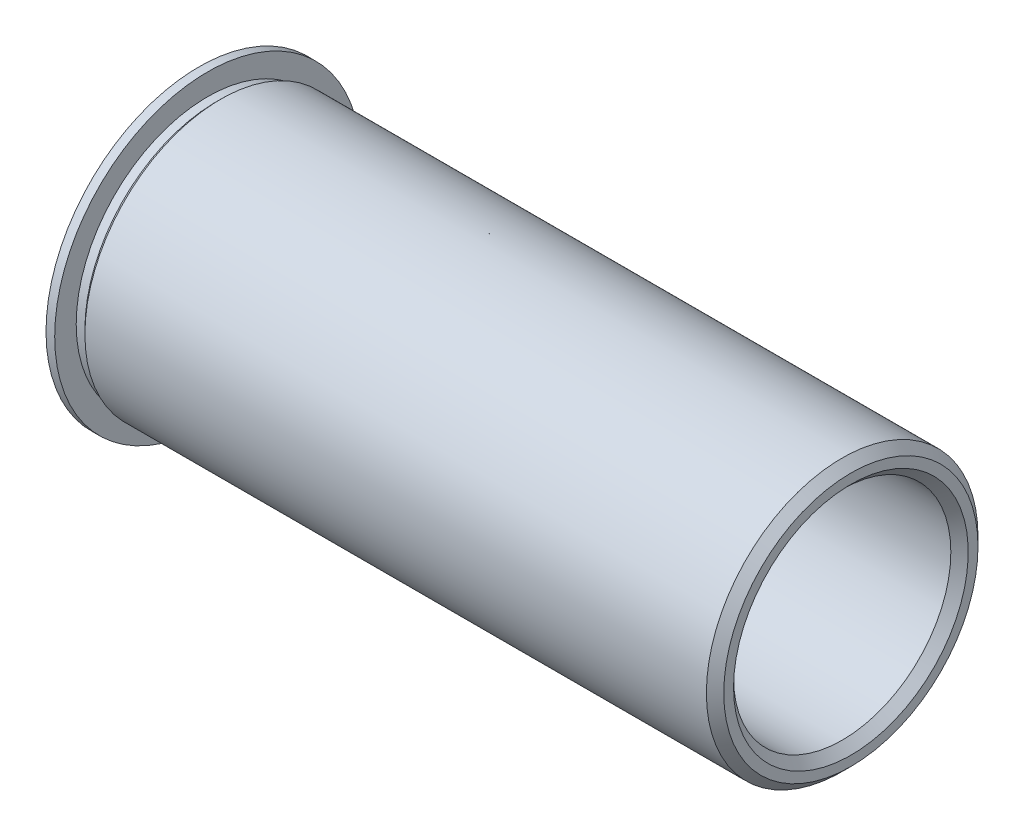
from build123d import *

# Parameters (mm, degrees)
SKETCH3_R          = 3.175
CUT_EXTRUDE1_DEPTH = 102.036000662
CHAMFER2_SIZE      = 0.254
CHAMFER3_SIZE      = 0.254


with BuildPart() as part:
    # Sketch2 → Revolve3 (revolve)
    with BuildSketch(Plane.XY, mode=Mode.PRIVATE) as revolve3_sk:
        Polygon((-64.141082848, 94.652687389), (-64.141082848, 99.123087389), (-63.887082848, 99.123087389), (-63.887082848, 98.494437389), (-63.633082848, 98.494437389), (-63.506082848, 98.621437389), (-45.345082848, 98.621437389), (-45.091082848, 98.367437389), (-45.091082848, 94.652687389), align=None)
    revolve(revolve3_sk.sketch.rotate(Axis((-64.141082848, 94.652687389, 0), (1, 0, 0)), 90), axis=Axis((-64.141082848, 94.652687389, 0), (1, 0, 0)))

    # Sketch3 → Cut-Extrude1 (cut, through all)
    with BuildSketch(Plane(origin=(-45.091082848, 0, 0), x_dir=(0, 0, -1), z_dir=(1, 0, 0))):
        with Locations((0, 94.652687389)):
            Circle(SKETCH3_R)
    extrude(amount=-CUT_EXTRUDE1_DEPTH, mode=Mode.SUBTRACT)

    # Chamfer2
    chamfer2_edges = [part.edges().sort_by_distance(p)[0] for p in [
        (-64.141082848, 94.652687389, 3.175),
    ]]
    chamfer(chamfer2_edges, length=CHAMFER2_SIZE)

    # Chamfer3
    chamfer3_edges = [part.edges().sort_by_distance(p)[0] for p in [
        (-45.091082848, 94.652687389, 3.175),
    ]]
    chamfer(chamfer3_edges, length=CHAMFER3_SIZE)


solid = part.part
